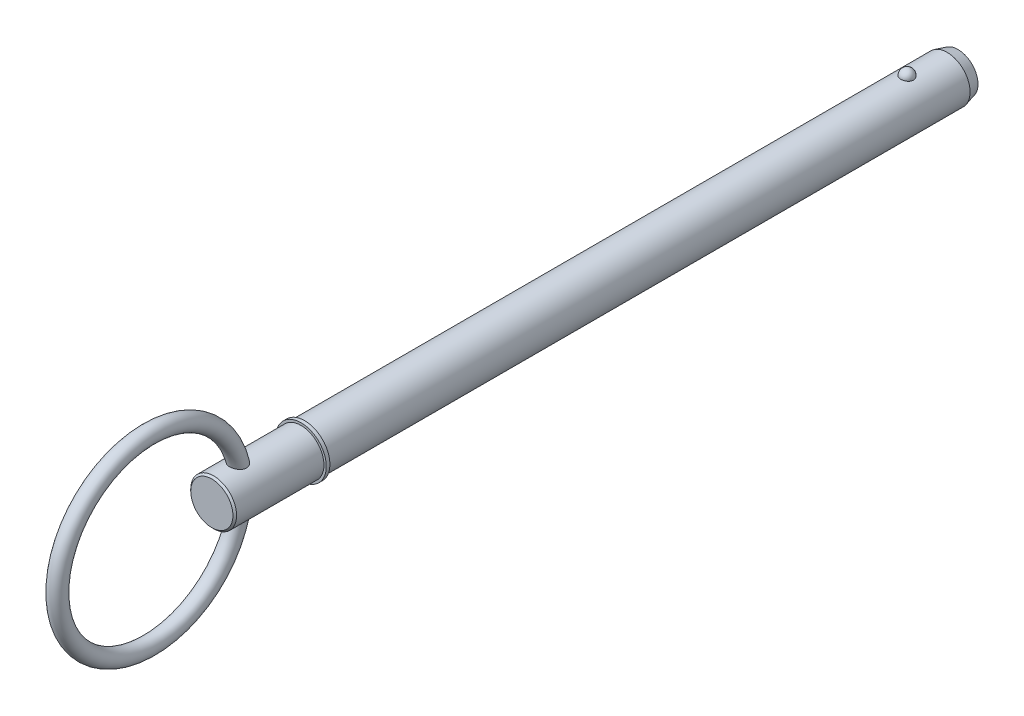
ISO-10303-21;
HEADER;
FILE_DESCRIPTION(('STEP AP214'),'2;1');
FILE_NAME('part.step','',(''),(''),'','','');
FILE_SCHEMA(('AUTOMOTIVE_DESIGN { 1 0 10303 214 1 1 1 1 }'));
ENDSEC;
DATA;
#1=APPLICATION_CONTEXT('core data for automotive mechanical design processes');
#2=APPLICATION_PROTOCOL_DEFINITION('international standard','automotive_design',2000,#1);
#3=PRODUCT_CONTEXT('',#1,'mechanical');
#4=PRODUCT('Part','Part','',(#3));
#5=PRODUCT_RELATED_PRODUCT_CATEGORY('part','',(#4));
#6=PRODUCT_DEFINITION_FORMATION('','',#4);
#7=PRODUCT_DEFINITION_CONTEXT('part definition',#1,'design');
#8=PRODUCT_DEFINITION('design','',#6,#7);
#9=PRODUCT_DEFINITION_SHAPE('','',#8);
#10=(LENGTH_UNIT() NAMED_UNIT(*) SI_UNIT(.MILLI.,.METRE.));
#11=(NAMED_UNIT(*) PLANE_ANGLE_UNIT() SI_UNIT($,.RADIAN.));
#12=(NAMED_UNIT(*) SI_UNIT($,.STERADIAN.) SOLID_ANGLE_UNIT());
#13=UNCERTAINTY_MEASURE_WITH_UNIT(LENGTH_MEASURE(1.E-05),#10,'distance_accuracy_value','');
#14=(GEOMETRIC_REPRESENTATION_CONTEXT(3) GLOBAL_UNCERTAINTY_ASSIGNED_CONTEXT((#13)) GLOBAL_UNIT_ASSIGNED_CONTEXT((#10,
#11,#12)) REPRESENTATION_CONTEXT('',''));
#15=CARTESIAN_POINT('',(0.,0.,0.));
#16=DIRECTION('',(0.,0.,1.));
#17=DIRECTION('',(1.,0.,0.));
#18=AXIS2_PLACEMENT_3D('',#15,#16,#17);
#19=CARTESIAN_POINT('',(0.,0.,165.1));
#20=DIRECTION('',(0.,0.,-1.));
#21=DIRECTION('',(-1.,0.,0.));
#22=AXIS2_PLACEMENT_3D('',#19,#20,#21);
#23=CYLINDRICAL_SURFACE('',#22,6.35);
#24=CARTESIAN_POINT('',(1.76243001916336,6.10051968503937,-1.78));
#25=CARTESIAN_POINT('',(1.76242835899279,6.10052111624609,-1.68050311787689));
#26=CARTESIAN_POINT('',(1.75431593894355,6.1028816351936,-1.58098521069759));
#27=CARTESIAN_POINT('',(1.72206027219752,6.11206037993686,-1.38476972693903));
#28=CARTESIAN_POINT('',(1.69791106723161,6.11888026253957,-1.28807321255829));
#29=CARTESIAN_POINT('',(1.63419596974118,6.13620287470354,-1.10029899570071));
#30=CARTESIAN_POINT('',(1.59463684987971,6.14670398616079,-1.00921884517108));
#31=CARTESIAN_POINT('',(1.50108569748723,6.17021534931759,-0.83516140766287));
#32=CARTESIAN_POINT('',(1.44709398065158,6.18322554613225,-0.752183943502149));
#33=CARTESIAN_POINT('',(1.3257243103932,6.21038081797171,-0.596209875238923));
#34=CARTESIAN_POINT('',(1.2582815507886,6.22453118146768,-0.523264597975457));
#35=CARTESIAN_POINT('',(1.11191624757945,6.25233390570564,-0.389855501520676));
#36=CARTESIAN_POINT('',(1.03299369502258,6.26598626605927,-0.329391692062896));
#37=CARTESIAN_POINT('',(0.866022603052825,6.29123226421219,-0.222793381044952));
#38=CARTESIAN_POINT('',(0.778000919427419,6.30283170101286,-0.176618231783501));
#39=CARTESIAN_POINT('',(0.59510847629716,6.32272058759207,-0.0996905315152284));
#40=CARTESIAN_POINT('',(0.500238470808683,6.33101040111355,-0.0689362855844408));
#41=CARTESIAN_POINT('',(0.308164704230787,6.34323464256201,-0.024159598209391));
#42=CARTESIAN_POINT('',(0.211033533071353,6.34724467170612,-0.00984637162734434));
#43=CARTESIAN_POINT('',(0.0156629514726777,6.3507318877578,0.00262058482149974));
#44=CARTESIAN_POINT('',(-0.0825763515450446,6.35020951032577,0.000775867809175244));
#45=CARTESIAN_POINT('',(-0.275890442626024,6.34473055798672,-0.0188727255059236));
#46=CARTESIAN_POINT('',(-0.370990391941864,6.3398374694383,-0.0364481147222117));
#47=CARTESIAN_POINT('',(-0.556805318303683,6.32622723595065,-0.0867447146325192));
#48=CARTESIAN_POINT('',(-0.647520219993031,6.31751002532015,-0.119466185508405));
#49=CARTESIAN_POINT('',(-0.822606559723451,6.29711353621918,-0.199386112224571));
#50=CARTESIAN_POINT('',(-0.906938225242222,6.28541739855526,-0.246667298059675));
#51=CARTESIAN_POINT('',(-1.06646479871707,6.26032612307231,-0.354365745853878));
#52=CARTESIAN_POINT('',(-1.14165877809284,6.24693081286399,-0.41478434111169));
#53=CARTESIAN_POINT('',(-1.2823514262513,6.21959142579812,-0.548435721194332));
#54=CARTESIAN_POINT('',(-1.34763761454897,6.2056417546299,-0.621891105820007));
#55=CARTESIAN_POINT('',(-1.4651153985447,6.17896241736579,-0.778815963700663));
#56=CARTESIAN_POINT('',(-1.51730606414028,6.16623283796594,-0.862286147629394));
#57=CARTESIAN_POINT('',(-1.60782211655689,6.14325839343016,-1.03799158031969));
#58=CARTESIAN_POINT('',(-1.64598111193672,6.13304379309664,-1.13031660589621));
#59=CARTESIAN_POINT('',(-1.70661885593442,6.11644899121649,-1.32030667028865));
#60=CARTESIAN_POINT('',(-1.72909805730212,6.11006867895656,-1.41797155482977));
#61=CARTESIAN_POINT('',(-1.75775019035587,6.1018881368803,-1.61543246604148));
#62=CARTESIAN_POINT('',(-1.76399136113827,6.10006874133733,-1.71521779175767));
#63=CARTESIAN_POINT('',(-1.76020715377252,6.10116172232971,-1.91445126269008));
#64=CARTESIAN_POINT('',(-1.75018221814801,6.10407397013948,-2.01389941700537));
#65=CARTESIAN_POINT('',(-1.71421005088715,6.11427232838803,-2.20912106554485));
#66=CARTESIAN_POINT('',(-1.68834262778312,6.12153651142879,-2.30491043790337));
#67=CARTESIAN_POINT('',(-1.62139543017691,6.1396067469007,-2.49066180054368));
#68=CARTESIAN_POINT('',(-1.5803150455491,6.15041294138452,-2.58062355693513));
#69=CARTESIAN_POINT('',(-1.48369112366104,6.17443456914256,-2.75271428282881));
#70=CARTESIAN_POINT('',(-1.42806998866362,6.18766281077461,-2.83479789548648));
#71=CARTESIAN_POINT('',(-1.30386620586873,6.21501934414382,-2.98832532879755));
#72=CARTESIAN_POINT('',(-1.23528306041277,6.22914767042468,-3.05976874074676));
#73=CARTESIAN_POINT('',(-1.08663999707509,6.25679135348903,-3.19029656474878));
#74=CARTESIAN_POINT('',(-1.00653826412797,6.27030422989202,-3.24933392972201));
#75=CARTESIAN_POINT('',(-0.837212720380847,6.29514770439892,-3.35304657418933));
#76=CARTESIAN_POINT('',(-0.747989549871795,6.30647845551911,-3.39772286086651));
#77=CARTESIAN_POINT('',(-0.564098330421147,6.32556124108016,-3.47096393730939));
#78=CARTESIAN_POINT('',(-0.469512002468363,6.33335611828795,-3.49972259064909));
#79=CARTESIAN_POINT('',(-0.27663389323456,6.34470628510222,-3.54113722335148));
#80=CARTESIAN_POINT('',(-0.17834256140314,6.34826208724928,-3.55379514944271));
#81=CARTESIAN_POINT('',(0.0171660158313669,6.35071525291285,-3.56255473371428));
#82=CARTESIAN_POINT('',(0.114368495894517,6.34969931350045,-3.55896450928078));
#83=CARTESIAN_POINT('',(0.306746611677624,6.34331695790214,-3.53603383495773));
#84=CARTESIAN_POINT('',(0.401922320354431,6.33795069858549,-3.51669395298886));
#85=CARTESIAN_POINT('',(0.587203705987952,6.32347219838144,-3.4629173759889));
#86=CARTESIAN_POINT('',(0.677327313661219,6.31437430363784,-3.42853846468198));
#87=CARTESIAN_POINT('',(0.850462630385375,6.29339543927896,-3.34564128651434));
#88=CARTESIAN_POINT('',(0.933473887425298,6.2815142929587,-3.29712212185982));
#89=CARTESIAN_POINT('',(1.09144542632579,6.25601750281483,-3.18638742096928));
#90=CARTESIAN_POINT('',(1.16626195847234,6.24237795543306,-3.12397237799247));
#91=CARTESIAN_POINT('',(1.304448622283,6.21497285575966,-2.98755865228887));
#92=CARTESIAN_POINT('',(1.36781676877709,6.20120728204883,-2.91355796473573));
#93=CARTESIAN_POINT('',(1.48252779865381,6.17479923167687,-2.75456133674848));
#94=CARTESIAN_POINT('',(1.53364167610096,6.16218052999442,-2.66939613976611));
#95=CARTESIAN_POINT('',(1.62109397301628,6.13975602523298,-2.49147502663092));
#96=CARTESIAN_POINT('',(1.657437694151,6.12994921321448,-2.39872184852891));
#97=CARTESIAN_POINT('',(1.71127844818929,6.11512175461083,-2.21887622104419));
#98=CARTESIAN_POINT('',(1.73042646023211,6.10968903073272,-2.13230770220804));
#99=CARTESIAN_POINT('',(1.75600284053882,6.10238739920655,-1.95716498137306));
#100=CARTESIAN_POINT('',(1.76243149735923,6.10051841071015,-1.86859082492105));
#101=CARTESIAN_POINT('',(1.76243001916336,6.10051968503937,-1.78));
#102=B_SPLINE_CURVE_WITH_KNOTS('',3,(#24,#25,#26,#27,#28,#29,#30,#31,#32,#33,#34,#35,#36,#37,
#38,#39,#40,#41,#42,#43,#44,#45,#46,#47,#48,#49,#50,#51,#52,#53,#54,#55,#56,#57,#58,#59,#60,#61,
#62,#63,#64,#65,#66,#67,#68,#69,#70,#71,#72,#73,#74,#75,#76,#77,#78,#79,#80,#81,#82,#83,#84,#85,
#86,#87,#88,#89,#90,#91,#92,#93,#94,#95,#96,#97,#98,#99,#100,#101),.UNSPECIFIED.,.T.,.F.,(4,2,2,
2,2,2,2,2,2,2,2,2,2,2,2,2,2,2,2,2,2,2,2,2,2,2,2,2,2,2,2,2,2,2,2,2,2,2,4),(0.,0.298172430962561,
0.596455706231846,0.894608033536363,1.19275383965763,1.49237238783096,1.79199116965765,
2.09074960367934,2.38947519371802,2.68283180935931,2.97616022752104,3.26529599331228,
3.5544367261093,3.84525169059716,4.13609618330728,4.43249276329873,4.72891038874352,
5.02873757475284,5.32855610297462,5.62711261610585,5.92566100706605,6.22271765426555,
6.519786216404,6.81847366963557,7.11717259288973,7.41698459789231,7.71677557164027,
8.01283014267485,8.30884891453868,8.59927798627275,8.88969658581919,9.17900899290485,
9.46833977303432,9.76212836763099,10.0559678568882,10.3549321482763,10.6537890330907,
10.9192841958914,11.1847733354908),.UNSPECIFIED.);
#103=CARTESIAN_POINT('',(1.76243001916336,6.10051968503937,-1.78));
#104=VERTEX_POINT('',#103);
#105=EDGE_CURVE('E103',#104,#104,#102,.T.);
#106=ORIENTED_EDGE('',*,*,#105,.T.);
#107=EDGE_LOOP('',(#106));
#108=FACE_BOUND('',#107,.T.);
#109=CARTESIAN_POINT('',(0.,0.,-12.8799999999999));
#110=DIRECTION('',(0.,0.,-1.));
#111=DIRECTION('',(-1.,0.,0.));
#112=AXIS2_PLACEMENT_3D('',#109,#110,#111);
#113=CIRCLE('',#112,6.35);
#114=CARTESIAN_POINT('',(6.35,0.,-12.8799999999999));
#115=VERTEX_POINT('',#114);
#116=EDGE_CURVE('E110',#115,#115,#113,.F.);
#117=ORIENTED_EDGE('',*,*,#116,.T.);
#118=EDGE_LOOP('',(#117));
#119=FACE_BOUND('',#118,.T.);
#120=CARTESIAN_POINT('',(0.,0.,165.1));
#121=DIRECTION('',(0.,0.,1.));
#122=DIRECTION('',(1.,0.,0.));
#123=AXIS2_PLACEMENT_3D('',#120,#121,#122);
#124=CIRCLE('',#123,6.35);
#125=CARTESIAN_POINT('',(6.35,0.,165.1));
#126=VERTEX_POINT('',#125);
#127=EDGE_CURVE('E108',#126,#126,#124,.T.);
#128=ORIENTED_EDGE('',*,*,#127,.F.);
#129=EDGE_LOOP('',(#128));
#130=FACE_BOUND('',#129,.T.);
#131=ADVANCED_FACE('F39',(#108,#119,#130),#23,.T.);
#132=CARTESIAN_POINT('',(0.,0.,-15.88));
#133=DIRECTION('',(0.,0.,-1.));
#134=DIRECTION('',(-1.,0.,0.));
#135=AXIS2_PLACEMENT_3D('',#132,#133,#134);
#136=PLANE('',#135);
#137=CARTESIAN_POINT('',(0.,0.,-15.88));
#138=DIRECTION('',(0.,0.,-1.));
#139=DIRECTION('',(-1.,0.,0.));
#140=AXIS2_PLACEMENT_3D('',#137,#138,#139);
#141=CIRCLE('',#140,5.54615242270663);
#142=CARTESIAN_POINT('',(5.54615242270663,0.,-15.88));
#143=VERTEX_POINT('',#142);
#144=EDGE_CURVE('E143',#143,#143,#141,.T.);
#145=ORIENTED_EDGE('',*,*,#144,.T.);
#146=EDGE_LOOP('',(#145));
#147=FACE_BOUND('',#146,.T.);
#148=ADVANCED_FACE('F89',(#147),#136,.T.);
#149=CARTESIAN_POINT('',(0.,0.,-15.88));
#150=DIRECTION('',(0.,0.,1.));
#151=DIRECTION('',(1.,0.,0.));
#152=AXIS2_PLACEMENT_3D('',#149,#150,#151);
#153=CONICAL_SURFACE('',#152,5.54615242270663,0.261799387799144);
#154=CARTESIAN_POINT('',(6.35,0.,-12.8799999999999));
#155=CARTESIAN_POINT('',(6.34162658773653,0.,-12.9112499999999));
#156=CARTESIAN_POINT('',(6.33325317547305,0.,-12.9424999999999));
#157=CARTESIAN_POINT('',(6.31650635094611,0.,-13.0049999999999));
#158=CARTESIAN_POINT('',(6.30813293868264,0.,-13.0362499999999));
#159=CARTESIAN_POINT('',(6.29138611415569,0.,-13.0987499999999));
#160=CARTESIAN_POINT('',(6.28301270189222,0.,-13.1299999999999));
#161=CARTESIAN_POINT('',(6.26626587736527,0.,-13.1924999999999));
#162=CARTESIAN_POINT('',(6.2578924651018,0.,-13.2237499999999));
#163=CARTESIAN_POINT('',(6.24114564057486,0.,-13.2862499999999));
#164=CARTESIAN_POINT('',(6.23277222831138,0.,-13.3174999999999));
#165=CARTESIAN_POINT('',(6.21602540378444,0.,-13.3799999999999));
#166=CARTESIAN_POINT('',(6.20765199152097,0.,-13.4112499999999));
#167=CARTESIAN_POINT('',(6.19090516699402,0.,-13.4737499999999));
#168=CARTESIAN_POINT('',(6.18253175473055,0.,-13.5049999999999));
#169=CARTESIAN_POINT('',(6.1657849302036,0.,-13.5674999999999));
#170=CARTESIAN_POINT('',(6.15741151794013,0.,-13.5987499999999));
#171=CARTESIAN_POINT('',(6.14066469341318,0.,-13.6612499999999));
#172=CARTESIAN_POINT('',(6.13229128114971,0.,-13.6924999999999));
#173=CARTESIAN_POINT('',(6.11554445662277,0.,-13.7549999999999));
#174=CARTESIAN_POINT('',(6.10717104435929,0.,-13.7862499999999));
#175=CARTESIAN_POINT('',(6.09042421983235,0.,-13.8487499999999));
#176=CARTESIAN_POINT('',(6.08205080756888,0.,-13.8799999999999));
#177=CARTESIAN_POINT('',(6.06530398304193,0.,-13.9424999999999));
#178=CARTESIAN_POINT('',(6.05693057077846,0.,-13.9737499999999));
#179=CARTESIAN_POINT('',(6.04018374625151,0.,-14.0362499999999));
#180=CARTESIAN_POINT('',(6.03181033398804,0.,-14.0674999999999));
#181=CARTESIAN_POINT('',(6.0150635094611,0.,-14.13));
#182=CARTESIAN_POINT('',(6.00669009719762,0.,-14.16125));
#183=CARTESIAN_POINT('',(5.98994327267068,0.,-14.22375));
#184=CARTESIAN_POINT('',(5.9815698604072,0.,-14.255));
#185=CARTESIAN_POINT('',(5.96482303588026,0.,-14.3175));
#186=CARTESIAN_POINT('',(5.95644962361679,0.,-14.34875));
#187=CARTESIAN_POINT('',(5.93970279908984,0.,-14.41125));
#188=CARTESIAN_POINT('',(5.93132938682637,0.,-14.4425));
#189=CARTESIAN_POINT('',(5.91458256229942,0.,-14.505));
#190=CARTESIAN_POINT('',(5.90620915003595,0.,-14.53625));
#191=CARTESIAN_POINT('',(5.889462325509,0.,-14.59875));
#192=CARTESIAN_POINT('',(5.88108891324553,0.,-14.63));
#193=CARTESIAN_POINT('',(5.86434208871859,0.,-14.6925));
#194=CARTESIAN_POINT('',(5.85596867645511,0.,-14.72375));
#195=CARTESIAN_POINT('',(5.83922185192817,0.,-14.78625));
#196=CARTESIAN_POINT('',(5.8308484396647,0.,-14.8175));
#197=CARTESIAN_POINT('',(5.81410161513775,0.,-14.88));
#198=CARTESIAN_POINT('',(5.80572820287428,0.,-14.91125));
#199=CARTESIAN_POINT('',(5.78898137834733,0.,-14.97375));
#200=CARTESIAN_POINT('',(5.78060796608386,0.,-15.005));
#201=CARTESIAN_POINT('',(5.76386114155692,0.,-15.0675));
#202=CARTESIAN_POINT('',(5.75548772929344,0.,-15.09875));
#203=CARTESIAN_POINT('',(5.7387409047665,0.,-15.16125));
#204=CARTESIAN_POINT('',(5.73036749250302,0.,-15.1925));
#205=CARTESIAN_POINT('',(5.71362066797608,0.,-15.255));
#206=CARTESIAN_POINT('',(5.70524725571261,0.,-15.28625));
#207=CARTESIAN_POINT('',(5.68850043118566,0.,-15.34875));
#208=CARTESIAN_POINT('',(5.68012701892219,0.,-15.38));
#209=CARTESIAN_POINT('',(5.66338019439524,0.,-15.4425));
#210=CARTESIAN_POINT('',(5.65500678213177,0.,-15.47375));
#211=CARTESIAN_POINT('',(5.63825995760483,0.,-15.53625));
#212=CARTESIAN_POINT('',(5.62988654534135,0.,-15.5675));
#213=CARTESIAN_POINT('',(5.61313972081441,0.,-15.63));
#214=CARTESIAN_POINT('',(5.60476630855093,0.,-15.66125));
#215=CARTESIAN_POINT('',(5.58801948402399,0.,-15.72375));
#216=CARTESIAN_POINT('',(5.57964607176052,0.,-15.755));
#217=CARTESIAN_POINT('',(5.56289924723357,0.,-15.8175));
#218=CARTESIAN_POINT('',(5.5545258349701,0.,-15.84875));
#219=CARTESIAN_POINT('',(5.54615242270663,0.,-15.88));
#220=B_SPLINE_CURVE_WITH_KNOTS('',3,(#154,#155,#156,#157,#158,#159,#160,#161,#162,#163,#164,
#165,#166,#167,#168,#169,#170,#171,#172,#173,#174,#175,#176,#177,#178,#179,#180,#181,#182,#183,
#184,#185,#186,#187,#188,#189,#190,#191,#192,#193,#194,#195,#196,#197,#198,#199,#200,#201,#202,
#203,#204,#205,#206,#207,#208,#209,#210,#211,#212,#213,#214,#215,#216,#217,#218,#219),
.UNSPECIFIED.,.F.,.F.,(4,2,2,2,2,2,2,2,2,2,2,2,2,2,2,2,2,2,2,2,2,2,2,2,2,2,2,2,2,2,2,2,4),(0.,
0.0970571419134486,0.194114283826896,0.291171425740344,0.388228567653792,0.485285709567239,
0.582342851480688,0.679399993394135,0.776457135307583,0.873514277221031,0.970571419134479,
1.06762856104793,1.16468570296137,1.26174284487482,1.35879998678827,1.45585712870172,
1.55291427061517,1.64997141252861,1.74702855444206,1.84408569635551,1.94114283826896,
2.0381999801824,2.13525712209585,2.2323142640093,2.32937140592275,2.4264285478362,
2.52348568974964,2.62054283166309,2.71759997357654,2.81465711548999,2.91171425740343,
3.00877139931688,3.10582854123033),.UNSPECIFIED.);
#221=EDGE_CURVE('BSEAM95',#115,#143,#220,.T.);
#222=ORIENTED_EDGE('',*,*,#116,.F.);
#223=ORIENTED_EDGE('',*,*,#144,.F.);
#224=ORIENTED_EDGE('',*,*,#221,.T.);
#225=ORIENTED_EDGE('',*,*,#221,.F.);
#226=EDGE_LOOP('',(#222,#224,#223,#225));
#227=FACE_BOUND('',#226,.T.);
#228=ADVANCED_FACE('F95',(#227),#153,.T.);
#229=CARTESIAN_POINT('',(0.,6.35,-1.78));
#230=DIRECTION('',(0.,1.,0.));
#231=DIRECTION('',(0.,0.,1.));
#232=AXIS2_PLACEMENT_3D('',#229,#230,#231);
#233=SPHERICAL_SURFACE('',#232,1.78);
#234=ORIENTED_EDGE('',*,*,#105,.F.);
#235=EDGE_LOOP('',(#234));
#236=FACE_BOUND('',#235,.T.);
#237=ADVANCED_FACE('F113',(#236),#233,.T.);
#238=CARTESIAN_POINT('',(0.,0.,165.1));
#239=DIRECTION('',(0.,0.,-1.));
#240=DIRECTION('',(-1.,0.,0.));
#241=AXIS2_PLACEMENT_3D('',#238,#239,#240);
#242=PLANE('',#241);
#243=ORIENTED_EDGE('',*,*,#127,.T.);
#244=EDGE_LOOP('',(#243));
#245=FACE_BOUND('',#244,.T.);
#246=CARTESIAN_POINT('',(0.,0.,165.1));
#247=DIRECTION('',(0.,0.,-1.));
#248=DIRECTION('',(-1.,0.,0.));
#249=AXIS2_PLACEMENT_3D('',#246,#247,#248);
#250=CIRCLE('',#249,7.);
#251=CARTESIAN_POINT('',(-7.,0.,165.1));
#252=VERTEX_POINT('',#251);
#253=EDGE_CURVE('E109',#252,#252,#250,.T.);
#254=ORIENTED_EDGE('',*,*,#253,.T.);
#255=EDGE_LOOP('',(#254));
#256=FACE_BOUND('',#255,.T.);
#257=ADVANCED_FACE('F117',(#245,#256),#242,.T.);
#258=CARTESIAN_POINT('',(0.,0.,33.7287874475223));
#259=DIRECTION('',(0.,0.,-1.));
#260=DIRECTION('',(-1.,0.,0.));
#261=AXIS2_PLACEMENT_3D('',#258,#259,#260);
#262=CYLINDRICAL_SURFACE('',#261,7.);
#263=CARTESIAN_POINT('',(0.,0.,166.1));
#264=DIRECTION('',(0.,0.,-1.));
#265=DIRECTION('',(-1.,0.,0.));
#266=AXIS2_PLACEMENT_3D('',#263,#264,#265);
#267=CIRCLE('',#266,7.);
#268=CARTESIAN_POINT('',(-7.,0.,166.1));
#269=VERTEX_POINT('',#268);
#270=EDGE_CURVE('E134',#269,#269,#267,.T.);
#271=ORIENTED_EDGE('',*,*,#270,.T.);
#272=EDGE_LOOP('',(#271));
#273=FACE_BOUND('',#272,.T.);
#274=ORIENTED_EDGE('',*,*,#253,.F.);
#275=EDGE_LOOP('',(#274));
#276=FACE_BOUND('',#275,.T.);
#277=ADVANCED_FACE('F121',(#273,#276),#262,.T.);
#278=CARTESIAN_POINT('',(0.,7.,166.1));
#279=DIRECTION('',(0.,0.,1.));
#280=DIRECTION('',(1.,0.,0.));
#281=AXIS2_PLACEMENT_3D('',#278,#279,#280);
#282=PLANE('',#281);
#283=CARTESIAN_POINT('',(0.,0.,166.1));
#284=DIRECTION('',(0.,0.,1.));
#285=DIRECTION('',(1.,0.,0.));
#286=AXIS2_PLACEMENT_3D('',#283,#284,#285);
#287=CIRCLE('',#286,6.35);
#288=CARTESIAN_POINT('',(6.35,0.,166.1));
#289=VERTEX_POINT('',#288);
#290=EDGE_CURVE('E112',#289,#289,#287,.T.);
#291=ORIENTED_EDGE('',*,*,#290,.F.);
#292=EDGE_LOOP('',(#291));
#293=FACE_BOUND('',#292,.T.);
#294=ORIENTED_EDGE('',*,*,#270,.F.);
#295=EDGE_LOOP('',(#294));
#296=FACE_BOUND('',#295,.T.);
#297=ADVANCED_FACE('F86',(#293,#296),#282,.T.);
#298=CARTESIAN_POINT('',(0.,0.,190.8));
#299=DIRECTION('',(0.,0.,-1.));
#300=DIRECTION('',(-1.,0.,0.));
#301=AXIS2_PLACEMENT_3D('',#298,#299,#300);
#302=CYLINDRICAL_SURFACE('',#301,6.35);
#303=CARTESIAN_POINT('',(-1.08120660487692,-6.25727514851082,181.55158117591));
#304=CARTESIAN_POINT('',(-0.97072437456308,-6.27636409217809,181.493879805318));
#305=CARTESIAN_POINT('',(-0.855136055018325,-6.29329984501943,181.445219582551));
#306=CARTESIAN_POINT('',(-0.61695868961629,-6.32109419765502,181.36705594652));
#307=CARTESIAN_POINT('',(-0.494369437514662,-6.3319526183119,181.33755309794));
#308=CARTESIAN_POINT('',(-0.245606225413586,-6.34647141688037,181.298367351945));
#309=CARTESIAN_POINT('',(-0.119431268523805,-6.35012977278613,181.288690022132));
#310=CARTESIAN_POINT('',(0.132849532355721,-6.34986313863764,181.289400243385));
#311=CARTESIAN_POINT('',(0.258955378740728,-6.34593843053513,181.299787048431));
#312=CARTESIAN_POINT('',(0.506912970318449,-6.33094785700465,181.340285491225));
#313=CARTESIAN_POINT('',(0.628781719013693,-6.31991516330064,181.370305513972));
#314=CARTESIAN_POINT('',(0.865486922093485,-6.29187143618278,181.449308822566));
#315=CARTESIAN_POINT('',(0.980322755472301,-6.27485987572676,181.498293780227));
#316=CARTESIAN_POINT('',(1.20050616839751,-6.23649440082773,181.614540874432));
#317=CARTESIAN_POINT('',(1.30578867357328,-6.2151135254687,181.681917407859));
#318=CARTESIAN_POINT('',(1.50311440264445,-6.17036440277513,181.833359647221));
#319=CARTESIAN_POINT('',(1.5951571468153,-6.14699608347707,181.917425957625));
#320=CARTESIAN_POINT('',(1.76326863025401,-6.10090072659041,182.100247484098));
#321=CARTESIAN_POINT('',(1.83935482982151,-6.07817301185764,182.198986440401));
#322=CARTESIAN_POINT('',(1.97338559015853,-6.03599268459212,182.408703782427));
#323=CARTESIAN_POINT('',(2.03133638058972,-6.01653894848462,182.519677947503));
#324=CARTESIAN_POINT('',(2.12591205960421,-5.98376466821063,182.747018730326));
#325=CARTESIAN_POINT('',(2.16315310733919,-5.97026970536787,182.863104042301));
#326=CARTESIAN_POINT('',(2.21830650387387,-5.94999923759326,183.100318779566));
#327=CARTESIAN_POINT('',(2.2362211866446,-5.94322292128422,183.221447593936));
#328=CARTESIAN_POINT('',(2.25273772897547,-5.93698111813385,183.463281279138));
#329=CARTESIAN_POINT('',(2.25163224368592,-5.93740484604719,183.583964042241));
#330=CARTESIAN_POINT('',(2.23167546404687,-5.94493297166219,183.823620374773));
#331=CARTESIAN_POINT('',(2.21281883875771,-5.9520393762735,183.942593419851));
#332=CARTESIAN_POINT('',(2.15679576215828,-5.97257680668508,184.183836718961));
#333=CARTESIAN_POINT('',(2.1185113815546,-5.98639144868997,184.30581287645));
#334=CARTESIAN_POINT('',(2.024702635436,-6.01876484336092,184.542284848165));
#335=CARTESIAN_POINT('',(1.96916879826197,-6.03732620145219,184.656776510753));
#336=CARTESIAN_POINT('',(1.83526629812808,-6.07945247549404,184.887995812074));
#337=CARTESIAN_POINT('',(1.75507038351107,-6.10334207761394,185.003611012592));
#338=CARTESIAN_POINT('',(1.5765788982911,-6.15186551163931,185.219894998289));
#339=CARTESIAN_POINT('',(1.47827192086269,-6.17649980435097,185.320554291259));
#340=CARTESIAN_POINT('',(1.26306696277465,-6.22410762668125,185.505023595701));
#341=CARTESIAN_POINT('',(1.14585214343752,-6.2470408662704,185.588478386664));
#342=CARTESIAN_POINT('',(0.896825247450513,-6.28760987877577,185.731400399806));
#343=CARTESIAN_POINT('',(0.765036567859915,-6.30525397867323,185.790905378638));
#344=CARTESIAN_POINT('',(0.509454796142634,-6.330648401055,185.875263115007));
#345=CARTESIAN_POINT('',(0.386964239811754,-6.33940909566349,185.903695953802));
#346=CARTESIAN_POINT('',(0.200813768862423,-6.3471308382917,185.928680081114));
#347=CARTESIAN_POINT('',(0.138353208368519,-6.34880140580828,185.934063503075));
#348=CARTESIAN_POINT('',(0.0131841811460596,-6.35029448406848,185.93887386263));
#349=CARTESIAN_POINT('',(-0.049524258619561,-6.35011719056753,185.938301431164));
#350=CARTESIAN_POINT('',(-0.219860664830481,-6.34710452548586,185.928597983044));
#351=CARTESIAN_POINT('',(-0.327176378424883,-6.34243953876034,185.913576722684));
#352=CARTESIAN_POINT('',(-0.537619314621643,-6.32808248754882,185.866673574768));
#353=CARTESIAN_POINT('',(-0.640746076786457,-6.31838987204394,185.834789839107));
#354=CARTESIAN_POINT('',(-0.841795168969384,-6.29478075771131,185.755337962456));
#355=CARTESIAN_POINT('',(-0.939631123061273,-6.28081033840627,185.70756888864));
#356=CARTESIAN_POINT('',(-1.12690564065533,-6.2499288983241,185.598513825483));
#357=CARTESIAN_POINT('',(-1.21634109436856,-6.2330167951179,185.537222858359));
#358=CARTESIAN_POINT('',(-1.39713031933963,-6.19517308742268,185.394039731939));
#359=CARTESIAN_POINT('',(-1.48711596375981,-6.17400700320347,185.310483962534));
#360=CARTESIAN_POINT('',(-1.65373642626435,-6.13148145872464,185.130996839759));
#361=CARTESIAN_POINT('',(-1.73036130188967,-6.11012186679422,185.03505636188));
#362=CARTESIAN_POINT('',(-1.87908981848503,-6.0661652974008,184.818620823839));
#363=CARTESIAN_POINT('',(-1.94902044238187,-6.04382072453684,184.696572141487));
#364=CARTESIAN_POINT('',(-2.06849605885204,-6.00398244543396,184.442070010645));
#365=CARTESIAN_POINT('',(-2.11803457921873,-5.98649027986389,184.309613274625));
#366=CARTESIAN_POINT('',(-2.19551930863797,-5.95851933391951,184.034593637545));
#367=CARTESIAN_POINT('',(-2.22297667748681,-5.94819998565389,183.891874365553));
#368=CARTESIAN_POINT('',(-2.25222139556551,-5.93719450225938,183.603480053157));
#369=CARTESIAN_POINT('',(-2.25403508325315,-5.93649848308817,183.457808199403));
#370=CARTESIAN_POINT('',(-2.23178480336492,-5.94489150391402,183.183804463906));
#371=CARTESIAN_POINT('',(-2.21035650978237,-5.95298402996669,183.055226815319));
#372=CARTESIAN_POINT('',(-2.14565882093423,-5.97660650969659,182.80440891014));
#373=CARTESIAN_POINT('',(-2.10239634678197,-5.99213410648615,182.682166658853));
#374=CARTESIAN_POINT('',(-1.99913159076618,-6.02732890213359,182.456747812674));
#375=CARTESIAN_POINT('',(-1.94060271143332,-6.0466053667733,182.352829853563));
#376=CARTESIAN_POINT('',(-1.80736340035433,-6.0877569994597,182.156534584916));
#377=CARTESIAN_POINT('',(-1.73265259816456,-6.10963222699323,182.064157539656));
#378=CARTESIAN_POINT('',(-1.56865095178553,-6.15378470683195,181.892603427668));
#379=CARTESIAN_POINT('',(-1.47928749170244,-6.17606344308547,181.813496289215));
#380=CARTESIAN_POINT('',(-1.28858731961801,-6.21864788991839,181.670675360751));
#381=CARTESIAN_POINT('',(-1.18724893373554,-6.23895332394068,181.606963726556));
#382=CARTESIAN_POINT('',(-1.08120660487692,-6.25727514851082,181.55158117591));
#383=B_SPLINE_CURVE_WITH_KNOTS('',3,(#303,#304,#305,#306,#307,#308,#309,#310,#311,#312,#313,
#314,#315,#316,#317,#318,#319,#320,#321,#322,#323,#324,#325,#326,#327,#328,#329,#330,#331,#332,
#333,#334,#335,#336,#337,#338,#339,#340,#341,#342,#343,#344,#345,#346,#347,#348,#349,#350,#351,
#352,#353,#354,#355,#356,#357,#358,#359,#360,#361,#362,#363,#364,#365,#366,#367,#368,#369,#370,
#371,#372,#373,#374,#375,#376,#377,#378,#379,#380,#381,#382),.UNSPECIFIED.,.T.,.F.,(4,2,2,2,2,2,
2,2,2,2,2,2,2,2,2,2,2,2,2,2,2,2,2,2,2,2,2,2,2,2,2,2,2,2,2,2,2,2,2,4),(0.,0.377861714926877,
0.755734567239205,1.13371352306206,1.51167842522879,1.88789208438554,2.26413891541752,
2.64278156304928,3.02143792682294,3.39967776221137,3.77778752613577,4.14394628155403,
4.51006081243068,4.87054720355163,5.23114188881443,5.61534494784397,5.99975934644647,
6.42600522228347,6.8525204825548,7.28711365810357,7.72101899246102,8.09666132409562,
8.28452949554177,8.47237776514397,8.7960795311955,9.11981678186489,9.44781545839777,
9.77593508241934,10.1483085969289,10.5209580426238,10.9463240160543,11.3718248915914,
11.8065046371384,12.2407378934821,12.6304236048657,13.0199858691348,13.3807583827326,
13.7415391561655,14.104165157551,14.4668419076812),.UNSPECIFIED.);
#384=CARTESIAN_POINT('',(-1.08120660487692,-6.25727514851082,181.55158117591));
#385=VERTEX_POINT('',#384);
#386=EDGE_CURVE('E10',#385,#385,#383,.T.);
#387=ORIENTED_EDGE('',*,*,#386,.F.);
#388=EDGE_LOOP('',(#387));
#389=FACE_BOUND('',#388,.T.);
#390=CARTESIAN_POINT('',(-1.08120660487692,6.25727514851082,181.55158117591));
#391=CARTESIAN_POINT('',(-1.19093168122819,6.23831652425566,181.608887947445));
#392=CARTESIAN_POINT('',(-1.29562751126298,6.21723224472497,181.675116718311));
#393=CARTESIAN_POINT('',(-1.49211272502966,6.17302620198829,181.824020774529));
#394=CARTESIAN_POINT('',(-1.58390200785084,6.14990442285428,181.906696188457));
#395=CARTESIAN_POINT('',(-1.75209695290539,6.10411985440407,182.086777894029));
#396=CARTESIAN_POINT('',(-1.82848346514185,6.08145766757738,182.184202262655));
#397=CARTESIAN_POINT('',(-1.96346259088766,6.0392331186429,182.391273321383));
#398=CARTESIAN_POINT('',(-2.02206050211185,6.01966983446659,182.500916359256));
#399=CARTESIAN_POINT('',(-2.11860444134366,5.9863659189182,182.726564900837));
#400=CARTESIAN_POINT('',(-2.15701637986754,5.97249571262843,182.842351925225));
#401=CARTESIAN_POINT('',(-2.21449304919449,5.95142584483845,183.079191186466));
#402=CARTESIAN_POINT('',(-2.23356015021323,5.94422536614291,183.200242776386));
#403=CARTESIAN_POINT('',(-2.25228141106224,5.93715610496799,183.441944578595));
#404=CARTESIAN_POINT('',(-2.25225786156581,5.93716560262,183.562567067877));
#405=CARTESIAN_POINT('',(-2.23442067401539,5.94389982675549,183.802277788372));
#406=CARTESIAN_POINT('',(-2.21660184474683,5.95062651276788,183.921365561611));
#407=CARTESIAN_POINT('',(-2.16272689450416,5.97042554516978,184.162705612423));
#408=CARTESIAN_POINT('',(-2.12559286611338,5.98387086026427,184.284684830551));
#409=CARTESIAN_POINT('',(-2.03409944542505,6.01558578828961,184.521342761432));
#410=CARTESIAN_POINT('',(-1.97973080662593,6.03385799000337,184.636017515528));
#411=CARTESIAN_POINT('',(-1.84828023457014,6.07549301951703,184.867865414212));
#412=CARTESIAN_POINT('',(-1.76936622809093,6.09919386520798,184.983943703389));
#413=CARTESIAN_POINT('',(-1.59344783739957,6.14749881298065,185.201420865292));
#414=CARTESIAN_POINT('',(-1.49643151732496,6.17210350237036,185.302809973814));
#415=CARTESIAN_POINT('',(-1.28333318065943,6.21994692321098,185.489508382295));
#416=CARTESIAN_POINT('',(-1.1668572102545,6.24314005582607,185.5743845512));
#417=CARTESIAN_POINT('',(-0.919062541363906,6.2843871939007,185.72034404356));
#418=CARTESIAN_POINT('',(-0.787766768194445,6.30244898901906,185.781463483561));
#419=CARTESIAN_POINT('',(-0.532335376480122,6.32876911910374,185.86911129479));
#420=CARTESIAN_POINT('',(-0.409516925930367,6.33800211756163,185.899123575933));
#421=CARTESIAN_POINT('',(-0.222636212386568,6.34640533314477,185.926338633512));
#422=CARTESIAN_POINT('',(-0.159893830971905,6.34829860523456,185.932442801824));
#423=CARTESIAN_POINT('',(-0.0340877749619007,6.35021985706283,185.93863417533));
#424=CARTESIAN_POINT('',(0.0289758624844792,6.35024804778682,185.93872206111));
#425=CARTESIAN_POINT('',(0.200008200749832,6.34776620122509,185.930732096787));
#426=CARTESIAN_POINT('',(0.307730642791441,6.34342046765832,185.91675007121));
#427=CARTESIAN_POINT('',(0.51913450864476,6.32963338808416,185.871765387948));
#428=CARTESIAN_POINT('',(0.622815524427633,6.3201915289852,185.840761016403));
#429=CARTESIAN_POINT('',(0.824580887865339,6.2970603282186,185.763086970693));
#430=CARTESIAN_POINT('',(0.922611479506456,6.28333629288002,185.716289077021));
#431=CARTESIAN_POINT('',(1.11039970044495,6.2528858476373,185.609122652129));
#432=CARTESIAN_POINT('',(1.20015435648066,6.23615836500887,185.548749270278));
#433=CARTESIAN_POINT('',(1.38155818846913,6.19866747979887,185.40760245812));
#434=CARTESIAN_POINT('',(1.4718764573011,6.17766310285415,185.325184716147));
#435=CARTESIAN_POINT('',(1.63933626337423,6.13535258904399,185.147946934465));
#436=CARTESIAN_POINT('',(1.71646809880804,6.11404624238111,185.053117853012));
#437=CARTESIAN_POINT('',(1.86660460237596,6.07002946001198,184.838851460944));
#438=CARTESIAN_POINT('',(1.93743710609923,6.04755477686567,184.717834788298));
#439=CARTESIAN_POINT('',(2.05894300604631,6.00727604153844,184.465280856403));
#440=CARTESIAN_POINT('',(2.1096091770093,5.98947366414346,184.333739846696));
#441=CARTESIAN_POINT('',(2.18982014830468,5.96062717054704,184.059758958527));
#442=CARTESIAN_POINT('',(2.21877575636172,5.94977267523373,183.917123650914));
#443=CARTESIAN_POINT('',(2.25104759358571,5.93764416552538,183.628595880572));
#444=CARTESIAN_POINT('',(2.25438985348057,5.93636042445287,183.482706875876));
#445=CARTESIAN_POINT('',(2.23498011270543,5.94368858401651,183.207731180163));
#446=CARTESIAN_POINT('',(2.21482640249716,5.95131530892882,183.078434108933));
#447=CARTESIAN_POINT('',(2.15248760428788,5.97414352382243,182.825969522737));
#448=CARTESIAN_POINT('',(2.11031020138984,5.98934237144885,182.702799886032));
#449=CARTESIAN_POINT('',(2.00904610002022,6.02402214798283,182.475783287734));
#450=CARTESIAN_POINT('',(1.95150192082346,6.04308594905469,182.371178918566));
#451=CARTESIAN_POINT('',(1.82009972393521,6.08395083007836,182.173382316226));
#452=CARTESIAN_POINT('',(1.74624088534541,6.10575204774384,182.080190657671));
#453=CARTESIAN_POINT('',(1.58309476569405,6.15008431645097,181.906164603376));
#454=CARTESIAN_POINT('',(1.49360904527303,6.17262128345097,181.825518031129));
#455=CARTESIAN_POINT('',(1.30231515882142,6.21579297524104,181.679836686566));
#456=CARTESIAN_POINT('',(1.20050521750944,6.23642742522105,181.61480416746));
#457=CARTESIAN_POINT('',(0.983786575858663,6.27432316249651,181.4998596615));
#458=CARTESIAN_POINT('',(0.86856325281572,6.29145558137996,181.450497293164));
#459=CARTESIAN_POINT('',(0.630994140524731,6.31970327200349,181.370885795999));
#460=CARTESIAN_POINT('',(0.508648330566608,6.33081852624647,181.340636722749));
#461=CARTESIAN_POINT('',(0.259933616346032,6.34590352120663,181.299879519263));
#462=CARTESIAN_POINT('',(0.133554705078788,6.34985380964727,181.289425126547));
#463=CARTESIAN_POINT('',(-0.119270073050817,6.35013815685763,181.288667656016));
#464=CARTESIAN_POINT('',(-0.245715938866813,6.34647233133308,181.298364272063));
#465=CARTESIAN_POINT('',(-0.494670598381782,6.33192772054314,181.337620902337));
#466=CARTESIAN_POINT('',(-0.617189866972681,6.3210701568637,181.367122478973));
#467=CARTESIAN_POINT('',(-0.855240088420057,6.29328476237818,181.445263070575));
#468=CARTESIAN_POINT('',(-0.970770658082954,6.27635659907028,181.493903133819));
#469=CARTESIAN_POINT('',(-1.08120660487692,6.25727514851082,181.55158117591));
#470=B_SPLINE_CURVE_WITH_KNOTS('',3,(#390,#391,#392,#393,#394,#395,#396,#397,#398,#399,#400,
#401,#402,#403,#404,#405,#406,#407,#408,#409,#410,#411,#412,#413,#414,#415,#416,#417,#418,#419,
#420,#421,#422,#423,#424,#425,#426,#427,#428,#429,#430,#431,#432,#433,#434,#435,#436,#437,#438,
#439,#440,#441,#442,#443,#444,#445,#446,#447,#448,#449,#450,#451,#452,#453,#454,#455,#456,#457,
#458,#459,#460,#461,#462,#463,#464,#465,#466,#467,#468,#469),.UNSPECIFIED.,.T.,.F.,(4,2,2,2,2,2,
2,2,2,2,2,2,2,2,2,2,2,2,2,2,2,2,2,2,2,2,2,2,2,2,2,2,2,2,2,2,2,2,2,4),(0.,0.375258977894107,
0.750520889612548,1.1262465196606,1.50186014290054,1.86837438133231,2.23484370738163,
2.5951263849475,2.95551419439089,3.33859924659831,3.7218901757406,4.14704029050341,
4.57247172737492,5.00788576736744,5.44263524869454,5.82040093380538,6.00932292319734,
6.19822354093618,6.52266071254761,6.84713055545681,7.17430063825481,7.50158780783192,
7.87233275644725,8.24334931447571,8.66748794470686,9.09177840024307,9.5272036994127,
9.96218641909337,10.3532895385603,10.7442562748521,11.1052784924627,11.4663188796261,
11.8323306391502,12.1983951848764,12.5761580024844,12.9539219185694,13.3327099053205,
13.7114921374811,14.0891615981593,14.4668517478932),.UNSPECIFIED.);
#471=CARTESIAN_POINT('',(-1.08120660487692,6.25727514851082,181.55158117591));
#472=VERTEX_POINT('',#471);
#473=EDGE_CURVE('E51',#472,#472,#470,.T.);
#474=ORIENTED_EDGE('',*,*,#473,.F.);
#475=EDGE_LOOP('',(#474));
#476=FACE_BOUND('',#475,.T.);
#477=CARTESIAN_POINT('',(0.,0.,190.3));
#478=DIRECTION('',(0.,0.,-1.));
#479=DIRECTION('',(-1.,0.,0.));
#480=AXIS2_PLACEMENT_3D('',#477,#478,#479);
#481=CIRCLE('',#480,6.35);
#482=CARTESIAN_POINT('',(-6.35,0.,190.3));
#483=VERTEX_POINT('',#482);
#484=EDGE_CURVE('E65',#483,#483,#481,.T.);
#485=ORIENTED_EDGE('',*,*,#484,.T.);
#486=EDGE_LOOP('',(#485));
#487=FACE_BOUND('',#486,.T.);
#488=ORIENTED_EDGE('',*,*,#290,.T.);
#489=EDGE_LOOP('',(#488));
#490=FACE_BOUND('',#489,.T.);
#491=ADVANCED_FACE('F70',(#389,#476,#487,#490),#302,.T.);
#492=CARTESIAN_POINT('',(0.,0.,190.8));
#493=DIRECTION('',(0.,0.,-1.));
#494=DIRECTION('',(-1.,0.,0.));
#495=AXIS2_PLACEMENT_3D('',#492,#493,#494);
#496=PLANE('',#495);
#497=CARTESIAN_POINT('',(0.,0.,190.8));
#498=DIRECTION('',(0.,0.,-1.));
#499=DIRECTION('',(-1.,0.,0.));
#500=AXIS2_PLACEMENT_3D('',#497,#498,#499);
#501=CIRCLE('',#500,5.84999999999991);
#502=CARTESIAN_POINT('',(-5.84999999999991,0.,190.8));
#503=VERTEX_POINT('',#502);
#504=EDGE_CURVE('E58',#503,#503,#501,.F.);
#505=ORIENTED_EDGE('',*,*,#504,.T.);
#506=EDGE_LOOP('',(#505));
#507=FACE_BOUND('',#506,.T.);
#508=ADVANCED_FACE('F77',(#507),#496,.F.);
#509=CARTESIAN_POINT('',(0.,0.,190.3));
#510=DIRECTION('',(0.,0.,-1.));
#511=DIRECTION('',(-1.,0.,0.));
#512=AXIS2_PLACEMENT_3D('',#509,#510,#511);
#513=CONICAL_SURFACE('',#512,6.35,0.785398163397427);
#514=ORIENTED_EDGE('',*,*,#504,.F.);
#515=EDGE_LOOP('',(#514));
#516=FACE_BOUND('',#515,.T.);
#517=ORIENTED_EDGE('',*,*,#484,.F.);
#518=EDGE_LOOP('',(#517));
#519=FACE_BOUND('',#518,.T.);
#520=ADVANCED_FACE('F41',(#516,#519),#513,.T.);
#521=CARTESIAN_POINT('',(0.,0.,208.2));
#522=DIRECTION('',(1.,0.,0.));
#523=DIRECTION('',(0.,0.,-1.));
#524=AXIS2_PLACEMENT_3D('',#521,#522,#523);
#525=TOROIDAL_SURFACE('',#524,25.4,2.25);
#526=ORIENTED_EDGE('',*,*,#386,.T.);
#527=EDGE_LOOP('',(#526));
#528=FACE_BOUND('',#527,.T.);
#529=ORIENTED_EDGE('',*,*,#473,.T.);
#530=EDGE_LOOP('',(#529));
#531=FACE_BOUND('',#530,.T.);
#532=ADVANCED_FACE('F74',(#528,#531),#525,.T.);
#533=CLOSED_SHELL('',(#131,#148,#228,#237,#257,#277,#297,#491,#508,#520,#532));
#534=MANIFOLD_SOLID_BREP('B2',#533);
#535=ADVANCED_BREP_SHAPE_REPRESENTATION('',(#18,#534),#14);
#536=SHAPE_DEFINITION_REPRESENTATION(#9,#535);
ENDSEC;
END-ISO-10303-21;
